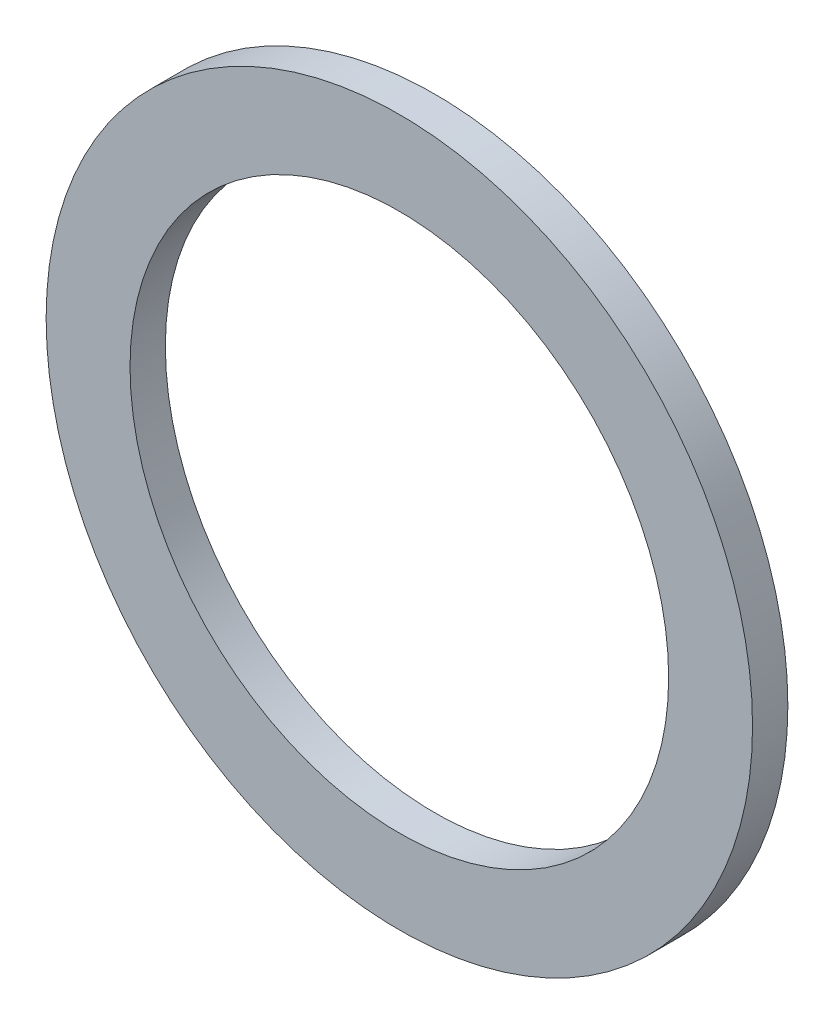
from build123d import *

# Parameters (mm, degrees)
ESQUISSE1_R      = 20
ESQUISSE1_R_2    = 15.25
EXTRUSION1_DEPTH = 2


with BuildPart() as part:
    # Esquisse1 → Extrusion1 (new body)
    with BuildSketch(Plane.XY):
        Circle(ESQUISSE1_R)
        Circle(ESQUISSE1_R_2, mode=Mode.SUBTRACT)
    extrude(amount=EXTRUSION1_DEPTH)


solid = part.part
